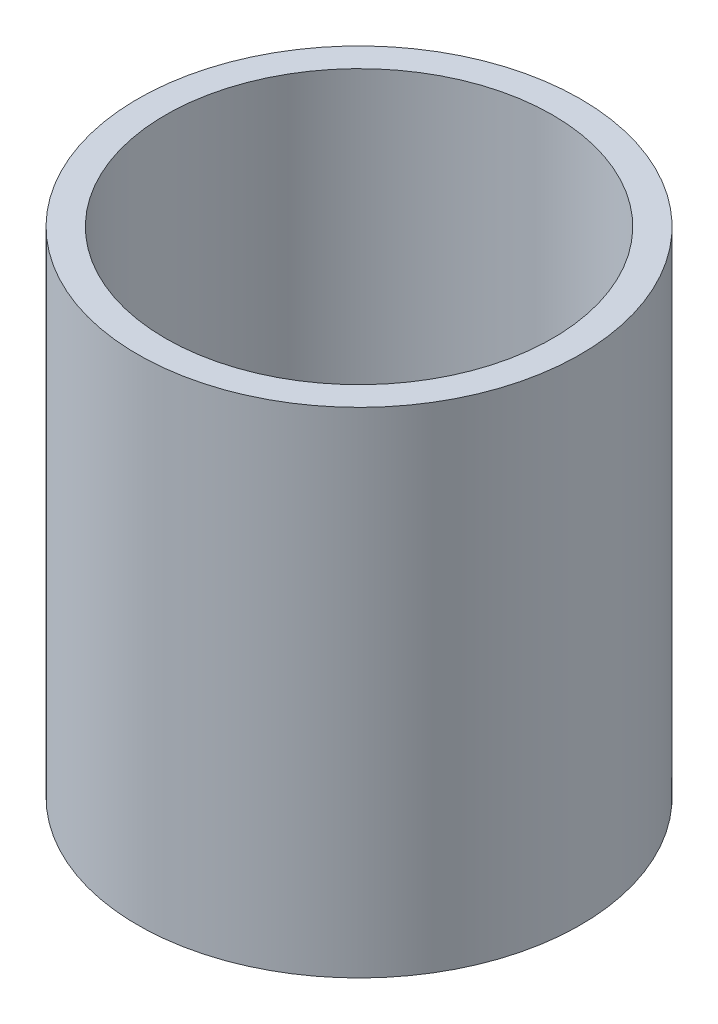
from build123d import *

# Parameters (mm, degrees)
SKETCH1_R           = 136.525
SKETCH1_R_2         = 119.38
BOSS_EXTRUDE1_DEPTH = 304.8


with BuildPart() as part:
    # Sketch1 → Boss-Extrude1 (new body)
    with BuildSketch(Plane(origin=(0, 0, 0), x_dir=(1, 0, 0), z_dir=(0, 1, 0))):
        with Locations(Location((0, 0, 0), (0, 0, 90))):
            Circle(SKETCH1_R)
        with Locations(Location((0, 0, 0), (0, 0, 90))):
            Circle(SKETCH1_R_2, mode=Mode.SUBTRACT)
    extrude(amount=BOSS_EXTRUDE1_DEPTH)


solid = part.part
